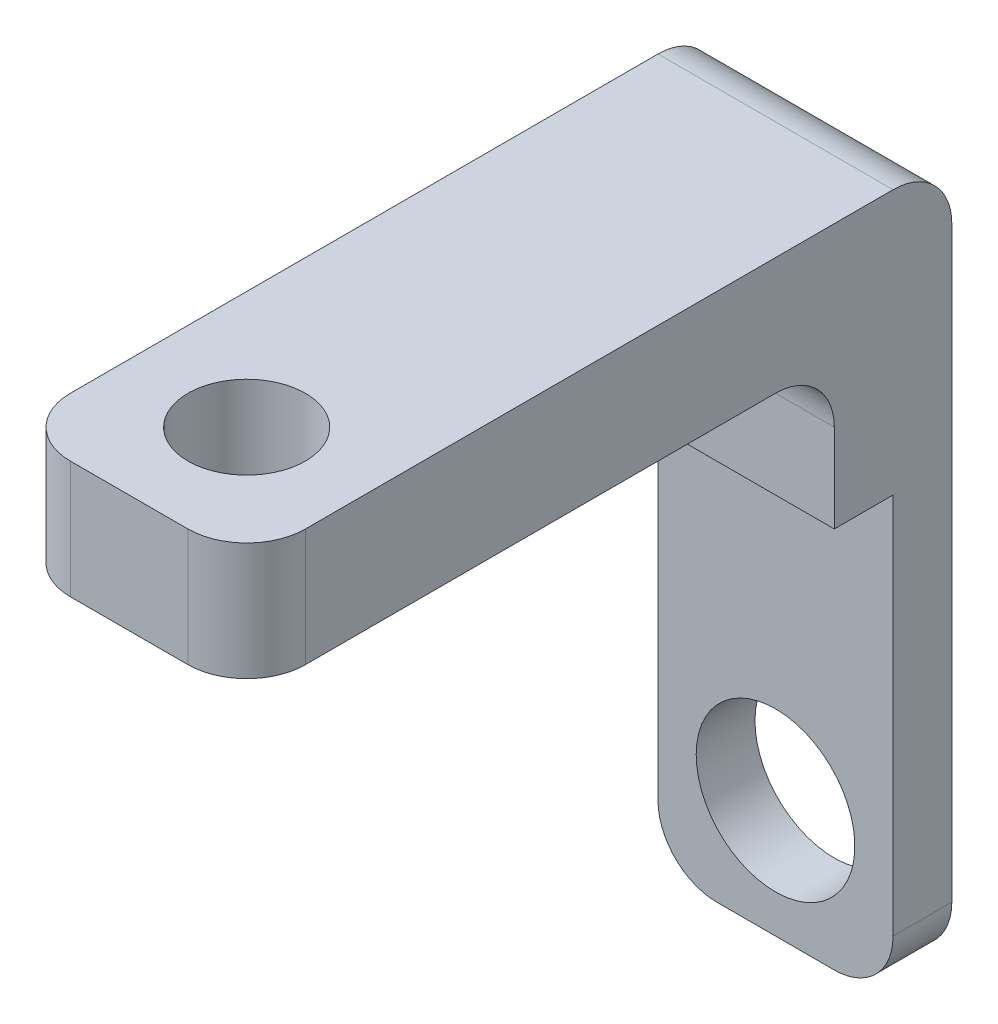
from build123d import *

# Parameters (mm, degrees)
SKETCH1_W           = 40
SKETCH1_H           = 120
BOSS_EXTRUDE1_DEPTH = 20
SKETCH3_W           = 40
SKETCH3_H           = 20
BOSS_EXTRUDE3_DEPTH = 100
SKETCH4_W           = 40
SKETCH4_H           = 75
CUT_EXTRUDE1_DEPTH  = 10
FILLET1_R           = 10
CUT_EXTRUDE2_REACH  = 159.48
SKETCH5_R           = 13.5
CUT_EXTRUDE3_REACH  = 137.647
SKETCH6_R           = 10
FILLET2_R           = 10


with BuildPart() as part:
    # Sketch1 → Boss-Extrude1 (new body)
    with BuildSketch(Plane(origin=(0, 0, 0), x_dir=(1, 0, 0), z_dir=(0, 1, 0))):
        Rectangle(SKETCH1_W, SKETCH1_H)
    extrude(amount=BOSS_EXTRUDE1_DEPTH)

    # Sketch3 → Boss-Extrude3 (add)
    with BuildSketch(Plane.XZ):
        with Locations((0, -50)):
            Rectangle(SKETCH3_W, SKETCH3_H)
    extrude(amount=BOSS_EXTRUDE3_DEPTH)

    # Sketch4 → Cut-Extrude1 (cut)
    with BuildSketch(Plane.XY.offset(-40)):
        with Locations((0, -62.5)):
            Rectangle(SKETCH4_W, SKETCH4_H)
    extrude(amount=-CUT_EXTRUDE1_DEPTH, mode=Mode.SUBTRACT)

    # Fillet1
    fillet1_edges = [part.edges().sort_by_distance(p)[0] for p in [
        (20, 10, 60),
        (-20, 10, 60),
        (20, -100, -55),
        (-20, -100, -55),
        (0, 20, -60),
    ]]
    fillet(fillet1_edges, radius=FILLET1_R)

    # Sketch5 → Cut-Extrude2 (cut, up to next)
    with BuildSketch(Plane(origin=(0, 0, -60), x_dir=(-1, 0, 0), z_dir=(0, 0, -1)), mode=Mode.PRIVATE) as cut_extrude2_sk1:
        with Locations((0, -80)):
            Circle(SKETCH5_R)
    cut_extrude2_tool1 = extrude(cut_extrude2_sk1.sketch, amount=-CUT_EXTRUDE2_REACH, mode=Mode.PRIVATE) & part.part
    add(cut_extrude2_tool1.solids().sort_by_distance((0, -80, -60))[0], mode=Mode.SUBTRACT)

    # Sketch6 → Cut-Extrude3 (cut, up to next)
    with BuildSketch(Plane(origin=(0, 20, 0), x_dir=(1, 0, 0), z_dir=(0, 1, 0)), mode=Mode.PRIVATE) as cut_extrude3_sk1:
        with Locations(Location((0, -40, 0), (0, 0, 270))):
            Circle(SKETCH6_R)
    cut_extrude3_tool1 = extrude(cut_extrude3_sk1.sketch, amount=-CUT_EXTRUDE3_REACH, mode=Mode.PRIVATE) & part.part
    add(cut_extrude3_tool1.solids().sort_by_distance((0, 20, 40))[0], mode=Mode.SUBTRACT)

    # Fillet2
    fillet2_edges = [part.edges().sort_by_distance(p)[0] for p in [
        (0, 0, -40),
    ]]
    fillet(fillet2_edges, radius=FILLET2_R)


solid = part.part
